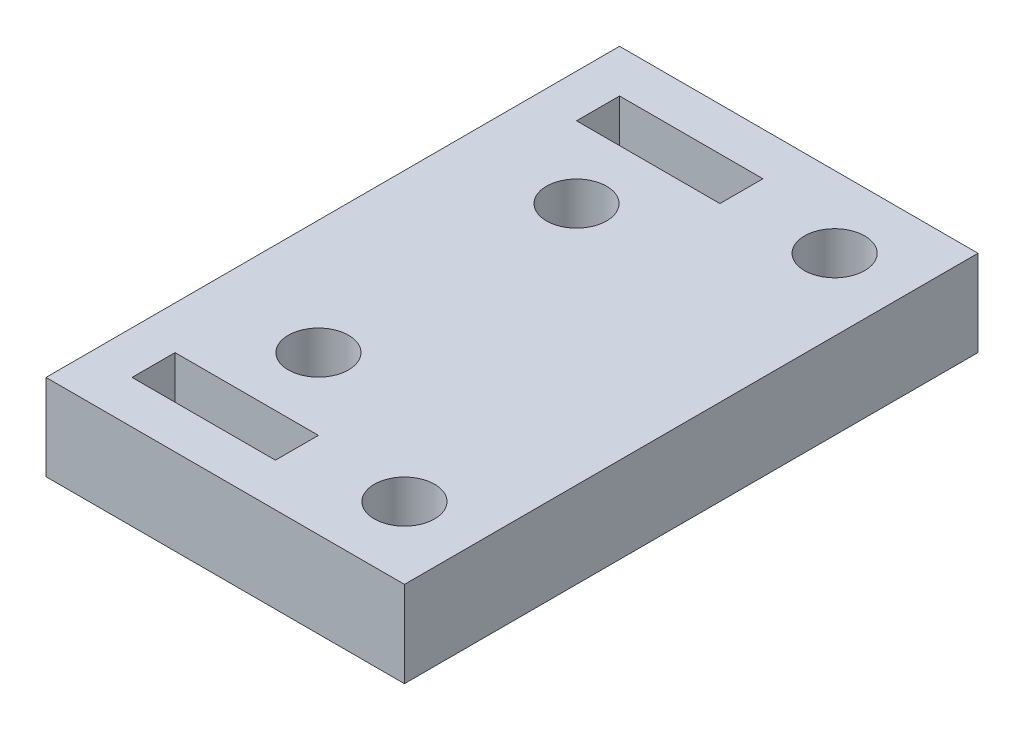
ISO-10303-21;
HEADER;
FILE_DESCRIPTION(('STEP AP214'),'2;1');
FILE_NAME('part.step','',(''),(''),'','','');
FILE_SCHEMA(('AUTOMOTIVE_DESIGN { 1 0 10303 214 1 1 1 1 }'));
ENDSEC;
DATA;
#1=APPLICATION_CONTEXT('core data for automotive mechanical design processes');
#2=APPLICATION_PROTOCOL_DEFINITION('international standard','automotive_design',2000,#1);
#3=PRODUCT_CONTEXT('',#1,'mechanical');
#4=PRODUCT('Part','Part','',(#3));
#5=PRODUCT_RELATED_PRODUCT_CATEGORY('part','',(#4));
#6=PRODUCT_DEFINITION_FORMATION('','',#4);
#7=PRODUCT_DEFINITION_CONTEXT('part definition',#1,'design');
#8=PRODUCT_DEFINITION('design','',#6,#7);
#9=PRODUCT_DEFINITION_SHAPE('','',#8);
#10=(LENGTH_UNIT() NAMED_UNIT(*) SI_UNIT(.MILLI.,.METRE.));
#11=(NAMED_UNIT(*) PLANE_ANGLE_UNIT() SI_UNIT($,.RADIAN.));
#12=(NAMED_UNIT(*) SI_UNIT($,.STERADIAN.) SOLID_ANGLE_UNIT());
#13=UNCERTAINTY_MEASURE_WITH_UNIT(LENGTH_MEASURE(1.E-05),#10,'distance_accuracy_value','');
#14=(GEOMETRIC_REPRESENTATION_CONTEXT(3) GLOBAL_UNCERTAINTY_ASSIGNED_CONTEXT((#13)) GLOBAL_UNIT_ASSIGNED_CONTEXT((#10,
#11,#12)) REPRESENTATION_CONTEXT('',''));
#15=CARTESIAN_POINT('',(0.,0.,0.));
#16=DIRECTION('',(0.,0.,1.));
#17=DIRECTION('',(1.,0.,0.));
#18=AXIS2_PLACEMENT_3D('',#15,#16,#17);
#19=CARTESIAN_POINT('',(0.,6.,-37.));
#20=DIRECTION('',(0.,0.,-1.));
#21=DIRECTION('',(-1.,0.,0.));
#22=AXIS2_PLACEMENT_3D('',#19,#20,#21);
#23=PLANE('',#22);
#24=DIRECTION('',(1.,0.,0.));
#25=VECTOR('',#24,1.);
#26=CARTESIAN_POINT('',(0.,0.,-37.));
#27=LINE('',#26,#25);
#28=CARTESIAN_POINT('',(-22.,0.,-37.));
#29=VERTEX_POINT('',#28);
#30=CARTESIAN_POINT('',(-12.,0.,-37.));
#31=VERTEX_POINT('',#30);
#32=EDGE_CURVE('E195',#29,#31,#27,.T.);
#33=ORIENTED_EDGE('',*,*,#32,.T.);
#34=DIRECTION('',(0.,-1.,0.));
#35=VECTOR('',#34,1.);
#36=CARTESIAN_POINT('',(-12.,6.,-37.));
#37=LINE('',#36,#35);
#38=CARTESIAN_POINT('',(-12.,6.,-37.));
#39=VERTEX_POINT('',#38);
#40=EDGE_CURVE('E11',#39,#31,#37,.T.);
#41=ORIENTED_EDGE('',*,*,#40,.F.);
#42=DIRECTION('',(1.,0.,0.));
#43=VECTOR('',#42,1.);
#44=CARTESIAN_POINT('',(0.,6.,-37.));
#45=LINE('',#44,#43);
#46=CARTESIAN_POINT('',(-22.,6.,-37.));
#47=VERTEX_POINT('',#46);
#48=EDGE_CURVE('E142',#47,#39,#45,.T.);
#49=ORIENTED_EDGE('',*,*,#48,.F.);
#50=DIRECTION('',(0.,-1.,0.));
#51=VECTOR('',#50,1.);
#52=CARTESIAN_POINT('',(-22.,6.,-37.));
#53=LINE('',#52,#51);
#54=EDGE_CURVE('E57',#47,#29,#53,.T.);
#55=ORIENTED_EDGE('',*,*,#54,.T.);
#56=EDGE_LOOP('',(#33,#41,#49,#55));
#57=FACE_BOUND('',#56,.T.);
#58=ADVANCED_FACE('F38',(#57),#23,.F.);
#59=CARTESIAN_POINT('',(-12.,6.,0.));
#60=DIRECTION('',(1.,0.,0.));
#61=DIRECTION('',(0.,0.,-1.));
#62=AXIS2_PLACEMENT_3D('',#59,#60,#61);
#63=PLANE('',#62);
#64=DIRECTION('',(0.,0.,1.));
#65=VECTOR('',#64,1.);
#66=CARTESIAN_POINT('',(-12.,0.,0.));
#67=LINE('',#66,#65);
#68=CARTESIAN_POINT('',(-12.,0.,-34.));
#69=VERTEX_POINT('',#68);
#70=EDGE_CURVE('E148',#31,#69,#67,.T.);
#71=ORIENTED_EDGE('',*,*,#70,.T.);
#72=DIRECTION('',(0.,-1.,0.));
#73=VECTOR('',#72,1.);
#74=CARTESIAN_POINT('',(-12.,6.,-34.));
#75=LINE('',#74,#73);
#76=CARTESIAN_POINT('',(-12.,6.,-34.));
#77=VERTEX_POINT('',#76);
#78=EDGE_CURVE('E48',#77,#69,#75,.T.);
#79=ORIENTED_EDGE('',*,*,#78,.F.);
#80=DIRECTION('',(0.,0.,1.));
#81=VECTOR('',#80,1.);
#82=CARTESIAN_POINT('',(-12.,6.,0.));
#83=LINE('',#82,#81);
#84=EDGE_CURVE('E135',#39,#77,#83,.T.);
#85=ORIENTED_EDGE('',*,*,#84,.F.);
#86=ORIENTED_EDGE('',*,*,#40,.T.);
#87=EDGE_LOOP('',(#71,#79,#85,#86));
#88=FACE_BOUND('',#87,.T.);
#89=ADVANCED_FACE('F147',(#88),#63,.F.);
#90=CARTESIAN_POINT('',(0.,6.,-34.));
#91=DIRECTION('',(0.,0.,-1.));
#92=DIRECTION('',(-1.,0.,0.));
#93=AXIS2_PLACEMENT_3D('',#90,#91,#92);
#94=PLANE('',#93);
#95=DIRECTION('',(1.,0.,0.));
#96=VECTOR('',#95,1.);
#97=CARTESIAN_POINT('',(0.,0.,-34.));
#98=LINE('',#97,#96);
#99=CARTESIAN_POINT('',(-22.,0.,-34.));
#100=VERTEX_POINT('',#99);
#101=EDGE_CURVE('E198',#100,#69,#98,.T.);
#102=ORIENTED_EDGE('',*,*,#101,.F.);
#103=DIRECTION('',(0.,-1.,0.));
#104=VECTOR('',#103,1.);
#105=CARTESIAN_POINT('',(-22.,6.,-34.));
#106=LINE('',#105,#104);
#107=CARTESIAN_POINT('',(-22.,6.,-34.));
#108=VERTEX_POINT('',#107);
#109=EDGE_CURVE('E95',#108,#100,#106,.T.);
#110=ORIENTED_EDGE('',*,*,#109,.F.);
#111=DIRECTION('',(1.,0.,0.));
#112=VECTOR('',#111,1.);
#113=CARTESIAN_POINT('',(0.,6.,-34.));
#114=LINE('',#113,#112);
#115=EDGE_CURVE('E141',#108,#77,#114,.T.);
#116=ORIENTED_EDGE('',*,*,#115,.T.);
#117=ORIENTED_EDGE('',*,*,#78,.T.);
#118=EDGE_LOOP('',(#102,#110,#116,#117));
#119=FACE_BOUND('',#118,.T.);
#120=ADVANCED_FACE('F152',(#119),#94,.T.);
#121=CARTESIAN_POINT('',(-25.,6.,0.));
#122=DIRECTION('',(-1.,0.,0.));
#123=DIRECTION('',(0.,0.,1.));
#124=AXIS2_PLACEMENT_3D('',#121,#122,#123);
#125=PLANE('',#124);
#126=DIRECTION('',(0.,0.,-1.));
#127=VECTOR('',#126,1.);
#128=CARTESIAN_POINT('',(-25.,0.,0.));
#129=LINE('',#128,#127);
#130=CARTESIAN_POINT('',(-25.,0.,0.));
#131=VERTEX_POINT('',#130);
#132=CARTESIAN_POINT('',(-25.,0.,-40.));
#133=VERTEX_POINT('',#132);
#134=EDGE_CURVE('E183',#131,#133,#129,.T.);
#135=ORIENTED_EDGE('',*,*,#134,.F.);
#136=DIRECTION('',(0.,-1.,0.));
#137=VECTOR('',#136,1.);
#138=CARTESIAN_POINT('',(-25.,6.,0.));
#139=LINE('',#138,#137);
#140=CARTESIAN_POINT('',(-25.,6.,0.));
#141=VERTEX_POINT('',#140);
#142=EDGE_CURVE('E208',#141,#131,#139,.T.);
#143=ORIENTED_EDGE('',*,*,#142,.F.);
#144=DIRECTION('',(0.,0.,-1.));
#145=VECTOR('',#144,1.);
#146=CARTESIAN_POINT('',(-25.,6.,0.));
#147=LINE('',#146,#145);
#148=CARTESIAN_POINT('',(-25.,6.,-40.));
#149=VERTEX_POINT('',#148);
#150=EDGE_CURVE('E429',#141,#149,#147,.T.);
#151=ORIENTED_EDGE('',*,*,#150,.T.);
#152=DIRECTION('',(0.,-1.,0.));
#153=VECTOR('',#152,1.);
#154=CARTESIAN_POINT('',(-25.,6.,-40.));
#155=LINE('',#154,#153);
#156=EDGE_CURVE('E210',#149,#133,#155,.T.);
#157=ORIENTED_EDGE('',*,*,#156,.T.);
#158=EDGE_LOOP('',(#135,#143,#151,#157));
#159=FACE_BOUND('',#158,.T.);
#160=ADVANCED_FACE('F272',(#159),#125,.T.);
#161=CARTESIAN_POINT('',(0.,6.,0.));
#162=DIRECTION('',(0.,0.,1.));
#163=DIRECTION('',(1.,0.,0.));
#164=AXIS2_PLACEMENT_3D('',#161,#162,#163);
#165=PLANE('',#164);
#166=DIRECTION('',(-1.,0.,0.));
#167=VECTOR('',#166,1.);
#168=CARTESIAN_POINT('',(0.,0.,0.));
#169=LINE('',#168,#167);
#170=CARTESIAN_POINT('',(0.,0.,0.));
#171=VERTEX_POINT('',#170);
#172=EDGE_CURVE('E186',#171,#131,#169,.T.);
#173=ORIENTED_EDGE('',*,*,#172,.F.);
#174=DIRECTION('',(0.,-1.,0.));
#175=VECTOR('',#174,1.);
#176=CARTESIAN_POINT('',(0.,6.,0.));
#177=LINE('',#176,#175);
#178=CARTESIAN_POINT('',(0.,6.,0.));
#179=VERTEX_POINT('',#178);
#180=EDGE_CURVE('E215',#179,#171,#177,.T.);
#181=ORIENTED_EDGE('',*,*,#180,.F.);
#182=DIRECTION('',(-1.,0.,0.));
#183=VECTOR('',#182,1.);
#184=CARTESIAN_POINT('',(0.,6.,0.));
#185=LINE('',#184,#183);
#186=EDGE_CURVE('E432',#179,#141,#185,.T.);
#187=ORIENTED_EDGE('',*,*,#186,.T.);
#188=ORIENTED_EDGE('',*,*,#142,.T.);
#189=EDGE_LOOP('',(#173,#181,#187,#188));
#190=FACE_BOUND('',#189,.T.);
#191=ADVANCED_FACE('F268',(#190),#165,.T.);
#192=CARTESIAN_POINT('',(0.,6.,0.));
#193=DIRECTION('',(-1.,0.,0.));
#194=DIRECTION('',(0.,0.,1.));
#195=AXIS2_PLACEMENT_3D('',#192,#193,#194);
#196=PLANE('',#195);
#197=DIRECTION('',(0.,0.,-1.));
#198=VECTOR('',#197,1.);
#199=CARTESIAN_POINT('',(0.,0.,0.));
#200=LINE('',#199,#198);
#201=CARTESIAN_POINT('',(0.,0.,-40.));
#202=VERTEX_POINT('',#201);
#203=EDGE_CURVE('E189',#171,#202,#200,.T.);
#204=ORIENTED_EDGE('',*,*,#203,.T.);
#205=DIRECTION('',(0.,-1.,0.));
#206=VECTOR('',#205,1.);
#207=CARTESIAN_POINT('',(0.,6.,-40.));
#208=LINE('',#207,#206);
#209=CARTESIAN_POINT('',(0.,6.,-40.));
#210=VERTEX_POINT('',#209);
#211=EDGE_CURVE('E212',#210,#202,#208,.T.);
#212=ORIENTED_EDGE('',*,*,#211,.F.);
#213=DIRECTION('',(0.,0.,-1.));
#214=VECTOR('',#213,1.);
#215=CARTESIAN_POINT('',(0.,6.,0.));
#216=LINE('',#215,#214);
#217=EDGE_CURVE('E439',#179,#210,#216,.T.);
#218=ORIENTED_EDGE('',*,*,#217,.F.);
#219=ORIENTED_EDGE('',*,*,#180,.T.);
#220=EDGE_LOOP('',(#204,#212,#218,#219));
#221=FACE_BOUND('',#220,.T.);
#222=ADVANCED_FACE('F265',(#221),#196,.F.);
#223=CARTESIAN_POINT('',(0.,6.,-3.));
#224=DIRECTION('',(0.,0.,-1.));
#225=DIRECTION('',(-1.,0.,0.));
#226=AXIS2_PLACEMENT_3D('',#223,#224,#225);
#227=PLANE('',#226);
#228=DIRECTION('',(1.,0.,0.));
#229=VECTOR('',#228,1.);
#230=CARTESIAN_POINT('',(0.,0.,-3.));
#231=LINE('',#230,#229);
#232=CARTESIAN_POINT('',(-22.,0.,-3.));
#233=VERTEX_POINT('',#232);
#234=CARTESIAN_POINT('',(-12.,0.,-3.));
#235=VERTEX_POINT('',#234);
#236=EDGE_CURVE('E171',#233,#235,#231,.T.);
#237=ORIENTED_EDGE('',*,*,#236,.F.);
#238=DIRECTION('',(0.,-1.,0.));
#239=VECTOR('',#238,1.);
#240=CARTESIAN_POINT('',(-22.,6.,-3.));
#241=LINE('',#240,#239);
#242=CARTESIAN_POINT('',(-22.,6.,-3.));
#243=VERTEX_POINT('',#242);
#244=EDGE_CURVE('E42',#243,#233,#241,.T.);
#245=ORIENTED_EDGE('',*,*,#244,.F.);
#246=DIRECTION('',(1.,0.,0.));
#247=VECTOR('',#246,1.);
#248=CARTESIAN_POINT('',(0.,6.,-3.));
#249=LINE('',#248,#247);
#250=CARTESIAN_POINT('',(-12.,6.,-3.));
#251=VERTEX_POINT('',#250);
#252=EDGE_CURVE('E235',#243,#251,#249,.T.);
#253=ORIENTED_EDGE('',*,*,#252,.T.);
#254=DIRECTION('',(0.,-1.,0.));
#255=VECTOR('',#254,1.);
#256=CARTESIAN_POINT('',(-12.,6.,-3.));
#257=LINE('',#256,#255);
#258=EDGE_CURVE('E161',#251,#235,#257,.T.);
#259=ORIENTED_EDGE('',*,*,#258,.T.);
#260=EDGE_LOOP('',(#237,#245,#253,#259));
#261=FACE_BOUND('',#260,.T.);
#262=ADVANCED_FACE('F234',(#261),#227,.T.);
#263=CARTESIAN_POINT('',(-22.,6.,0.));
#264=DIRECTION('',(-1.,0.,0.));
#265=DIRECTION('',(0.,0.,1.));
#266=AXIS2_PLACEMENT_3D('',#263,#264,#265);
#267=PLANE('',#266);
#268=DIRECTION('',(0.,0.,-1.));
#269=VECTOR('',#268,1.);
#270=CARTESIAN_POINT('',(-22.,0.,0.));
#271=LINE('',#270,#269);
#272=CARTESIAN_POINT('',(-22.,0.,-6.00000000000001));
#273=VERTEX_POINT('',#272);
#274=EDGE_CURVE('E174',#233,#273,#271,.T.);
#275=ORIENTED_EDGE('',*,*,#274,.T.);
#276=DIRECTION('',(0.,-1.,0.));
#277=VECTOR('',#276,1.);
#278=CARTESIAN_POINT('',(-22.,6.,-6.00000000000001));
#279=LINE('',#278,#277);
#280=CARTESIAN_POINT('',(-22.,6.,-6.00000000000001));
#281=VERTEX_POINT('',#280);
#282=EDGE_CURVE('E220',#281,#273,#279,.T.);
#283=ORIENTED_EDGE('',*,*,#282,.F.);
#284=DIRECTION('',(0.,0.,-1.));
#285=VECTOR('',#284,1.);
#286=CARTESIAN_POINT('',(-22.,6.,0.));
#287=LINE('',#286,#285);
#288=EDGE_CURVE('E228',#243,#281,#287,.T.);
#289=ORIENTED_EDGE('',*,*,#288,.F.);
#290=ORIENTED_EDGE('',*,*,#244,.T.);
#291=EDGE_LOOP('',(#275,#283,#289,#290));
#292=FACE_BOUND('',#291,.T.);
#293=ADVANCED_FACE('F226',(#292),#267,.F.);
#294=CARTESIAN_POINT('',(0.,6.,-6.00000000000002));
#295=DIRECTION('',(0.,0.,-1.));
#296=DIRECTION('',(-1.,0.,0.));
#297=AXIS2_PLACEMENT_3D('',#294,#295,#296);
#298=PLANE('',#297);
#299=DIRECTION('',(1.,0.,0.));
#300=VECTOR('',#299,1.);
#301=CARTESIAN_POINT('',(0.,0.,-6.00000000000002));
#302=LINE('',#301,#300);
#303=CARTESIAN_POINT('',(-12.,0.,-6.00000000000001));
#304=VERTEX_POINT('',#303);
#305=EDGE_CURVE('E177',#273,#304,#302,.T.);
#306=ORIENTED_EDGE('',*,*,#305,.T.);
#307=DIRECTION('',(0.,-1.,0.));
#308=VECTOR('',#307,1.);
#309=CARTESIAN_POINT('',(-12.,6.,-6.00000000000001));
#310=LINE('',#309,#308);
#311=CARTESIAN_POINT('',(-12.,6.,-6.00000000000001));
#312=VERTEX_POINT('',#311);
#313=EDGE_CURVE('E219',#312,#304,#310,.T.);
#314=ORIENTED_EDGE('',*,*,#313,.F.);
#315=DIRECTION('',(1.,0.,0.));
#316=VECTOR('',#315,1.);
#317=CARTESIAN_POINT('',(0.,6.,-6.00000000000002));
#318=LINE('',#317,#316);
#319=EDGE_CURVE('E445',#281,#312,#318,.T.);
#320=ORIENTED_EDGE('',*,*,#319,.F.);
#321=ORIENTED_EDGE('',*,*,#282,.T.);
#322=EDGE_LOOP('',(#306,#314,#320,#321));
#323=FACE_BOUND('',#322,.T.);
#324=ADVANCED_FACE('F242',(#323),#298,.F.);
#325=CARTESIAN_POINT('',(-22.,6.,0.));
#326=DIRECTION('',(1.,0.,0.));
#327=DIRECTION('',(0.,0.,-1.));
#328=AXIS2_PLACEMENT_3D('',#325,#326,#327);
#329=PLANE('',#328);
#330=DIRECTION('',(0.,0.,1.));
#331=VECTOR('',#330,1.);
#332=CARTESIAN_POINT('',(-22.,0.,0.));
#333=LINE('',#332,#331);
#334=EDGE_CURVE('E200',#29,#100,#333,.T.);
#335=ORIENTED_EDGE('',*,*,#334,.F.);
#336=ORIENTED_EDGE('',*,*,#54,.F.);
#337=DIRECTION('',(0.,0.,1.));
#338=VECTOR('',#337,1.);
#339=CARTESIAN_POINT('',(-22.,6.,0.));
#340=LINE('',#339,#338);
#341=EDGE_CURVE('E153',#47,#108,#340,.T.);
#342=ORIENTED_EDGE('',*,*,#341,.T.);
#343=ORIENTED_EDGE('',*,*,#109,.T.);
#344=EDGE_LOOP('',(#335,#336,#342,#343));
#345=FACE_BOUND('',#344,.T.);
#346=ADVANCED_FACE('F244',(#345),#329,.T.);
#347=CARTESIAN_POINT('',(0.,6.,-40.));
#348=DIRECTION('',(0.,0.,1.));
#349=DIRECTION('',(1.,0.,0.));
#350=AXIS2_PLACEMENT_3D('',#347,#348,#349);
#351=PLANE('',#350);
#352=DIRECTION('',(-1.,0.,0.));
#353=VECTOR('',#352,1.);
#354=CARTESIAN_POINT('',(0.,0.,-40.));
#355=LINE('',#354,#353);
#356=EDGE_CURVE('E192',#202,#133,#355,.T.);
#357=ORIENTED_EDGE('',*,*,#356,.T.);
#358=ORIENTED_EDGE('',*,*,#156,.F.);
#359=DIRECTION('',(-1.,0.,0.));
#360=VECTOR('',#359,1.);
#361=CARTESIAN_POINT('',(0.,6.,-40.));
#362=LINE('',#361,#360);
#363=EDGE_CURVE('E433',#210,#149,#362,.T.);
#364=ORIENTED_EDGE('',*,*,#363,.F.);
#365=ORIENTED_EDGE('',*,*,#211,.T.);
#366=EDGE_LOOP('',(#357,#358,#364,#365));
#367=FACE_BOUND('',#366,.T.);
#368=ADVANCED_FACE('F250',(#367),#351,.F.);
#369=CARTESIAN_POINT('',(-12.,6.,0.));
#370=DIRECTION('',(-1.,0.,0.));
#371=DIRECTION('',(0.,0.,1.));
#372=AXIS2_PLACEMENT_3D('',#369,#370,#371);
#373=PLANE('',#372);
#374=DIRECTION('',(0.,0.,-1.));
#375=VECTOR('',#374,1.);
#376=CARTESIAN_POINT('',(-12.,0.,0.));
#377=LINE('',#376,#375);
#378=EDGE_CURVE('E180',#235,#304,#377,.T.);
#379=ORIENTED_EDGE('',*,*,#378,.F.);
#380=ORIENTED_EDGE('',*,*,#258,.F.);
#381=DIRECTION('',(0.,0.,-1.));
#382=VECTOR('',#381,1.);
#383=CARTESIAN_POINT('',(-12.,6.,0.));
#384=LINE('',#383,#382);
#385=EDGE_CURVE('E240',#251,#312,#384,.T.);
#386=ORIENTED_EDGE('',*,*,#385,.T.);
#387=ORIENTED_EDGE('',*,*,#313,.T.);
#388=EDGE_LOOP('',(#379,#380,#386,#387));
#389=FACE_BOUND('',#388,.T.);
#390=ADVANCED_FACE('F239',(#389),#373,.T.);
#391=CARTESIAN_POINT('',(-17.,6.,-29.));
#392=DIRECTION('',(0.,-1.,0.));
#393=DIRECTION('',(0.,0.,-1.));
#394=AXIS2_PLACEMENT_3D('',#391,#392,#393);
#395=CYLINDRICAL_SURFACE('',#394,2.1);
#396=CARTESIAN_POINT('',(-17.,6.,-29.));
#397=DIRECTION('',(0.,1.,0.));
#398=DIRECTION('',(0.,0.,1.));
#399=AXIS2_PLACEMENT_3D('',#396,#397,#398);
#400=CIRCLE('',#399,2.1);
#401=CARTESIAN_POINT('',(-17.,6.,-26.9));
#402=VERTEX_POINT('',#401);
#403=EDGE_CURVE('E424',#402,#402,#400,.T.);
#404=ORIENTED_EDGE('',*,*,#403,.T.);
#405=EDGE_LOOP('',(#404));
#406=FACE_BOUND('',#405,.T.);
#407=CARTESIAN_POINT('',(-17.,0.,-29.));
#408=DIRECTION('',(0.,1.,0.));
#409=DIRECTION('',(0.,0.,1.));
#410=AXIS2_PLACEMENT_3D('',#407,#408,#409);
#411=CIRCLE('',#410,2.1);
#412=CARTESIAN_POINT('',(-17.,0.,-26.9));
#413=VERTEX_POINT('',#412);
#414=EDGE_CURVE('E168',#413,#413,#411,.T.);
#415=ORIENTED_EDGE('',*,*,#414,.F.);
#416=EDGE_LOOP('',(#415));
#417=FACE_BOUND('',#416,.T.);
#418=ADVANCED_FACE('F277',(#406,#417),#395,.F.);
#419=CARTESIAN_POINT('',(-5.,6.,-35.));
#420=DIRECTION('',(0.,-1.,0.));
#421=DIRECTION('',(0.,0.,-1.));
#422=AXIS2_PLACEMENT_3D('',#419,#420,#421);
#423=CYLINDRICAL_SURFACE('',#422,2.1);
#424=CARTESIAN_POINT('',(-5.,6.,-35.));
#425=DIRECTION('',(0.,1.,0.));
#426=DIRECTION('',(0.,0.,1.));
#427=AXIS2_PLACEMENT_3D('',#424,#425,#426);
#428=CIRCLE('',#427,2.1);
#429=CARTESIAN_POINT('',(-5.,6.,-32.9));
#430=VERTEX_POINT('',#429);
#431=EDGE_CURVE('E421',#430,#430,#428,.T.);
#432=ORIENTED_EDGE('',*,*,#431,.T.);
#433=EDGE_LOOP('',(#432));
#434=FACE_BOUND('',#433,.T.);
#435=CARTESIAN_POINT('',(-5.,0.,-35.));
#436=DIRECTION('',(0.,1.,0.));
#437=DIRECTION('',(0.,0.,1.));
#438=AXIS2_PLACEMENT_3D('',#435,#436,#437);
#439=CIRCLE('',#438,2.1);
#440=CARTESIAN_POINT('',(-5.,0.,-32.9));
#441=VERTEX_POINT('',#440);
#442=EDGE_CURVE('E165',#441,#441,#439,.T.);
#443=ORIENTED_EDGE('',*,*,#442,.F.);
#444=EDGE_LOOP('',(#443));
#445=FACE_BOUND('',#444,.T.);
#446=ADVANCED_FACE('F281',(#434,#445),#423,.F.);
#447=CARTESIAN_POINT('',(-5.,6.,-5.));
#448=DIRECTION('',(0.,-1.,0.));
#449=DIRECTION('',(0.,0.,-1.));
#450=AXIS2_PLACEMENT_3D('',#447,#448,#449);
#451=CYLINDRICAL_SURFACE('',#450,2.1);
#452=CARTESIAN_POINT('',(-5.,6.,-5.));
#453=DIRECTION('',(0.,1.,0.));
#454=DIRECTION('',(0.,0.,1.));
#455=AXIS2_PLACEMENT_3D('',#452,#453,#454);
#456=CIRCLE('',#455,2.1);
#457=CARTESIAN_POINT('',(-5.,6.,-2.9));
#458=VERTEX_POINT('',#457);
#459=EDGE_CURVE('E206',#458,#458,#456,.F.);
#460=ORIENTED_EDGE('',*,*,#459,.F.);
#461=EDGE_LOOP('',(#460));
#462=FACE_BOUND('',#461,.T.);
#463=CARTESIAN_POINT('',(-5.,0.,-5.));
#464=DIRECTION('',(0.,1.,0.));
#465=DIRECTION('',(0.,0.,1.));
#466=AXIS2_PLACEMENT_3D('',#463,#464,#465);
#467=CIRCLE('',#466,2.1);
#468=CARTESIAN_POINT('',(-5.,0.,-2.9));
#469=VERTEX_POINT('',#468);
#470=EDGE_CURVE('E162',#469,#469,#467,.F.);
#471=ORIENTED_EDGE('',*,*,#470,.T.);
#472=EDGE_LOOP('',(#471));
#473=FACE_BOUND('',#472,.T.);
#474=ADVANCED_FACE('F40',(#462,#473),#451,.F.);
#475=CARTESIAN_POINT('',(-17.,6.,-11.));
#476=DIRECTION('',(0.,-1.,0.));
#477=DIRECTION('',(0.,0.,-1.));
#478=AXIS2_PLACEMENT_3D('',#475,#476,#477);
#479=CYLINDRICAL_SURFACE('',#478,2.1);
#480=CARTESIAN_POINT('',(-17.,6.,-11.));
#481=DIRECTION('',(0.,1.,0.));
#482=DIRECTION('',(0.,0.,1.));
#483=AXIS2_PLACEMENT_3D('',#480,#481,#482);
#484=CIRCLE('',#483,2.1);
#485=CARTESIAN_POINT('',(-17.,6.,-8.90000000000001));
#486=VERTEX_POINT('',#485);
#487=EDGE_CURVE('E155',#486,#486,#484,.F.);
#488=ORIENTED_EDGE('',*,*,#487,.F.);
#489=EDGE_LOOP('',(#488));
#490=FACE_BOUND('',#489,.T.);
#491=CARTESIAN_POINT('',(-17.,0.,-11.));
#492=DIRECTION('',(0.,1.,0.));
#493=DIRECTION('',(0.,0.,1.));
#494=AXIS2_PLACEMENT_3D('',#491,#492,#493);
#495=CIRCLE('',#494,2.1);
#496=CARTESIAN_POINT('',(-17.,0.,-8.90000000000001));
#497=VERTEX_POINT('',#496);
#498=EDGE_CURVE('E203',#497,#497,#495,.F.);
#499=ORIENTED_EDGE('',*,*,#498,.T.);
#500=EDGE_LOOP('',(#499));
#501=FACE_BOUND('',#500,.T.);
#502=ADVANCED_FACE('F339',(#490,#501),#479,.F.);
#503=CARTESIAN_POINT('',(0.,6.,0.));
#504=DIRECTION('',(0.,1.,0.));
#505=DIRECTION('',(0.,0.,1.));
#506=AXIS2_PLACEMENT_3D('',#503,#504,#505);
#507=PLANE('',#506);
#508=ORIENTED_EDGE('',*,*,#459,.T.);
#509=EDGE_LOOP('',(#508));
#510=FACE_BOUND('',#509,.T.);
#511=ORIENTED_EDGE('',*,*,#431,.F.);
#512=EDGE_LOOP('',(#511));
#513=FACE_BOUND('',#512,.T.);
#514=ORIENTED_EDGE('',*,*,#403,.F.);
#515=EDGE_LOOP('',(#514));
#516=FACE_BOUND('',#515,.T.);
#517=ORIENTED_EDGE('',*,*,#252,.F.);
#518=ORIENTED_EDGE('',*,*,#288,.T.);
#519=ORIENTED_EDGE('',*,*,#319,.T.);
#520=ORIENTED_EDGE('',*,*,#385,.F.);
#521=EDGE_LOOP('',(#517,#518,#519,#520));
#522=FACE_BOUND('',#521,.T.);
#523=ORIENTED_EDGE('',*,*,#150,.F.);
#524=ORIENTED_EDGE('',*,*,#186,.F.);
#525=ORIENTED_EDGE('',*,*,#217,.T.);
#526=ORIENTED_EDGE('',*,*,#363,.T.);
#527=EDGE_LOOP('',(#523,#524,#525,#526));
#528=FACE_BOUND('',#527,.T.);
#529=ORIENTED_EDGE('',*,*,#48,.T.);
#530=ORIENTED_EDGE('',*,*,#84,.T.);
#531=ORIENTED_EDGE('',*,*,#115,.F.);
#532=ORIENTED_EDGE('',*,*,#341,.F.);
#533=EDGE_LOOP('',(#529,#530,#531,#532));
#534=FACE_BOUND('',#533,.T.);
#535=ORIENTED_EDGE('',*,*,#487,.T.);
#536=EDGE_LOOP('',(#535));
#537=FACE_BOUND('',#536,.T.);
#538=ADVANCED_FACE('F137',(#510,#513,#516,#522,#528,#534,#537),#507,.T.);
#539=CARTESIAN_POINT('',(0.,0.,0.));
#540=DIRECTION('',(0.,1.,0.));
#541=DIRECTION('',(0.,0.,1.));
#542=AXIS2_PLACEMENT_3D('',#539,#540,#541);
#543=PLANE('',#542);
#544=ORIENTED_EDGE('',*,*,#470,.F.);
#545=EDGE_LOOP('',(#544));
#546=FACE_BOUND('',#545,.T.);
#547=ORIENTED_EDGE('',*,*,#442,.T.);
#548=EDGE_LOOP('',(#547));
#549=FACE_BOUND('',#548,.T.);
#550=ORIENTED_EDGE('',*,*,#414,.T.);
#551=EDGE_LOOP('',(#550));
#552=FACE_BOUND('',#551,.T.);
#553=ORIENTED_EDGE('',*,*,#236,.T.);
#554=ORIENTED_EDGE('',*,*,#378,.T.);
#555=ORIENTED_EDGE('',*,*,#305,.F.);
#556=ORIENTED_EDGE('',*,*,#274,.F.);
#557=EDGE_LOOP('',(#553,#554,#555,#556));
#558=FACE_BOUND('',#557,.T.);
#559=ORIENTED_EDGE('',*,*,#134,.T.);
#560=ORIENTED_EDGE('',*,*,#356,.F.);
#561=ORIENTED_EDGE('',*,*,#203,.F.);
#562=ORIENTED_EDGE('',*,*,#172,.T.);
#563=EDGE_LOOP('',(#559,#560,#561,#562));
#564=FACE_BOUND('',#563,.T.);
#565=ORIENTED_EDGE('',*,*,#32,.F.);
#566=ORIENTED_EDGE('',*,*,#334,.T.);
#567=ORIENTED_EDGE('',*,*,#101,.T.);
#568=ORIENTED_EDGE('',*,*,#70,.F.);
#569=EDGE_LOOP('',(#565,#566,#567,#568));
#570=FACE_BOUND('',#569,.T.);
#571=ORIENTED_EDGE('',*,*,#498,.F.);
#572=EDGE_LOOP('',(#571));
#573=FACE_BOUND('',#572,.T.);
#574=ADVANCED_FACE('F231',(#546,#549,#552,#558,#564,#570,#573),#543,.F.);
#575=CLOSED_SHELL('',(#58,#89,#120,#160,#191,#222,#262,#293,#324,#346,#368,#390,#418,#446,#474,
#502,#538,#574));
#576=MANIFOLD_SOLID_BREP('B2',#575);
#577=ADVANCED_BREP_SHAPE_REPRESENTATION('',(#18,#576),#14);
#578=SHAPE_DEFINITION_REPRESENTATION(#9,#577);
ENDSEC;
END-ISO-10303-21;
